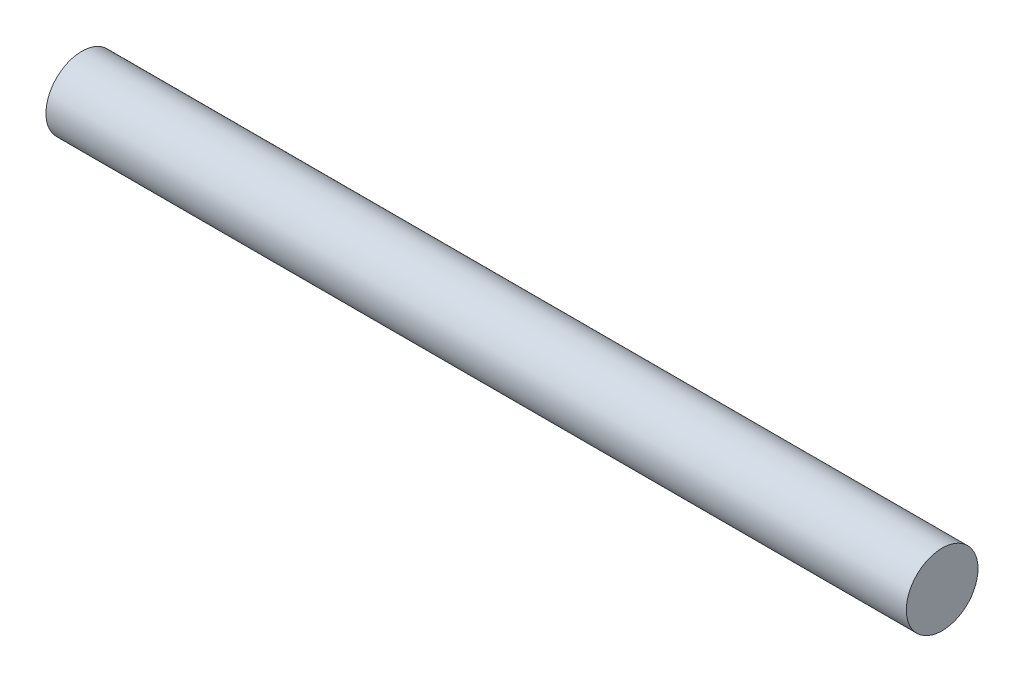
from build123d import *

# Parameters (mm, degrees)
SKETCH1_R           = 5
BOSS_EXTRUDE1_DEPTH = 120


with BuildPart() as part:
    # Sketch1 → Boss-Extrude1 (new body)
    with BuildSketch(Plane(origin=(0, 0, 0), x_dir=(0, 0, -1), z_dir=(1, 0, 0))):
        Circle(SKETCH1_R)
    extrude(amount=BOSS_EXTRUDE1_DEPTH)


solid = part.part
